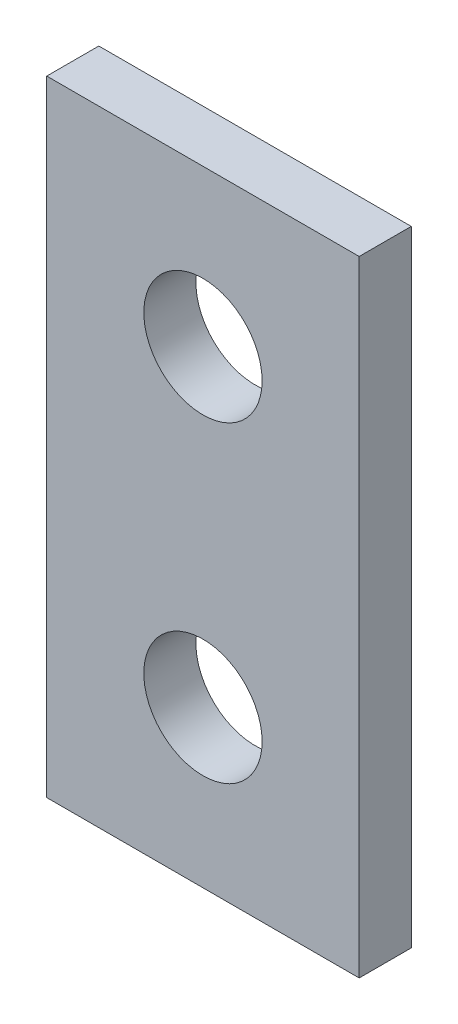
from build123d import *

# Parameters (mm, degrees)
SKETCH1_W           = 9.525
SKETCH1_H           = 19.05
BOSS_EXTRUDE1_DEPTH = 1.5875
SKETCH2_R           = 1.8034
CUT_EXTRUDE1_DEPTH  = 11.766948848


with BuildPart() as part:
    # Sketch1 → Boss-Extrude1 (new body)
    with BuildSketch(Plane.XY):
        Rectangle(SKETCH1_W, SKETCH1_H)
    extrude(amount=-BOSS_EXTRUDE1_DEPTH)

    # Sketch2 → Cut-Extrude1 (cut, through all)
    with BuildSketch(Plane.XY):
        with Locations((0, 4.7625)):
            Circle(SKETCH2_R)
        with Locations((0, -4.7625)):
            Circle(SKETCH2_R)
    extrude(amount=-CUT_EXTRUDE1_DEPTH, mode=Mode.SUBTRACT)


solid = part.part
